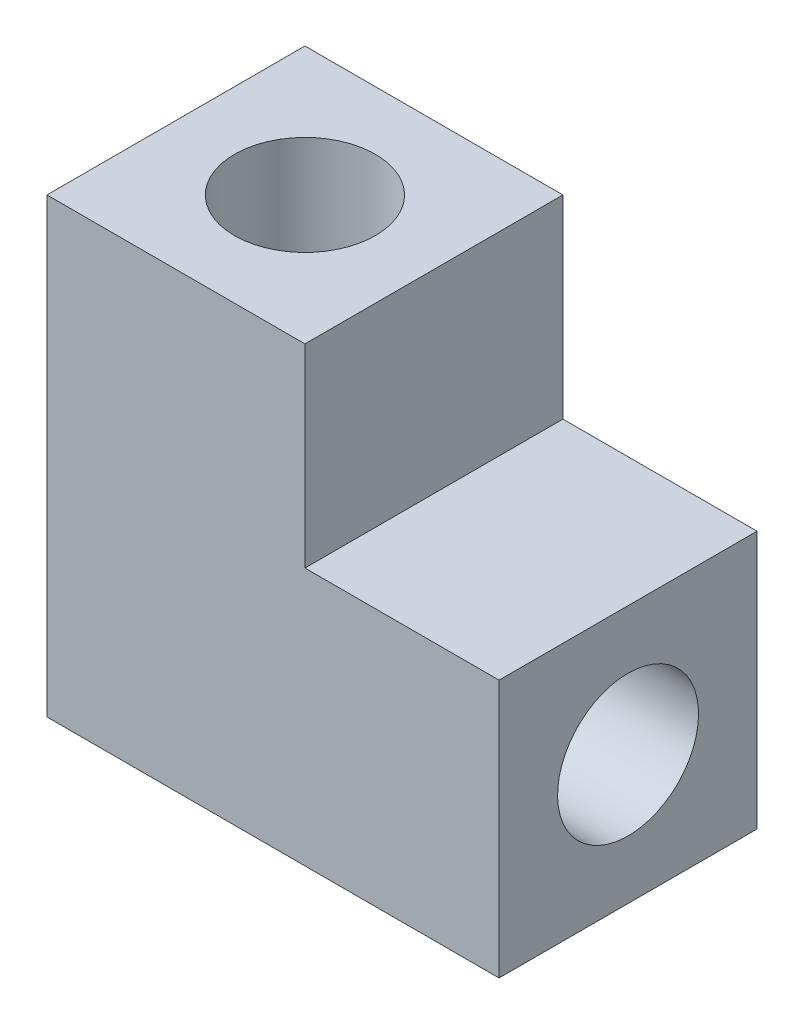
from build123d import *

# Parameters (mm, degrees)
SKETCH1_W          = 17
SKETCH1_H          = 17
EXTRUDE1_DEPTH     = 9.7
CUT_EXTRUDE1_REACH = 27.925
SKETCH2_W          = 7.3
SKETCH2_H          = 7.3
SKETCH3_R          = 2.65
CUT_EXTRUDE2_DEPTH = 8.79
SKETCH5_R          = 2.65
CUT_EXTRUDE3_DEPTH = 8.79


with BuildPart() as part:
    # Sketch1 → Extrude1 (new body)
    with BuildSketch(Plane.XY):
        with Locations((8.5, 8.5)):
            Rectangle(SKETCH1_W, SKETCH1_H)
    extrude(amount=EXTRUDE1_DEPTH)

    # Sketch2 → Cut-Extrude1 (cut, up to next)
    with BuildSketch(Plane.XY.offset(9.7), mode=Mode.PRIVATE) as cut_extrude1_sk1:
        with Locations((13.35, 13.35)):
            Rectangle(SKETCH2_W, SKETCH2_H)
    cut_extrude1_tool1 = extrude(cut_extrude1_sk1.sketch, amount=-CUT_EXTRUDE1_REACH, mode=Mode.PRIVATE) & part.part
    add(cut_extrude1_tool1.solids().sort_by_distance((13.35, 13.35, 9.7))[0], mode=Mode.SUBTRACT)

    # Sketch3 → Cut-Extrude2 (cut)
    with BuildSketch(Plane(origin=(0, 17, 0), x_dir=(-1, 0, 0), z_dir=(0, 1, 0))):
        with Locations(Location((-4.85, 4.85, 0), (0, 0, 90))):
            Circle(SKETCH3_R)
    extrude(amount=-CUT_EXTRUDE2_DEPTH, mode=Mode.SUBTRACT)

    # Sketch5 → Cut-Extrude3 (cut)
    with BuildSketch(Plane(origin=(17, 0, 0), x_dir=(0, 0, -1), z_dir=(1, 0, 0))):
        with Locations(Location((-4.85, 4.85, 0), (0, 0, 90))):
            Circle(SKETCH5_R)
    extrude(amount=-CUT_EXTRUDE3_DEPTH, mode=Mode.SUBTRACT)


solid = part.part
